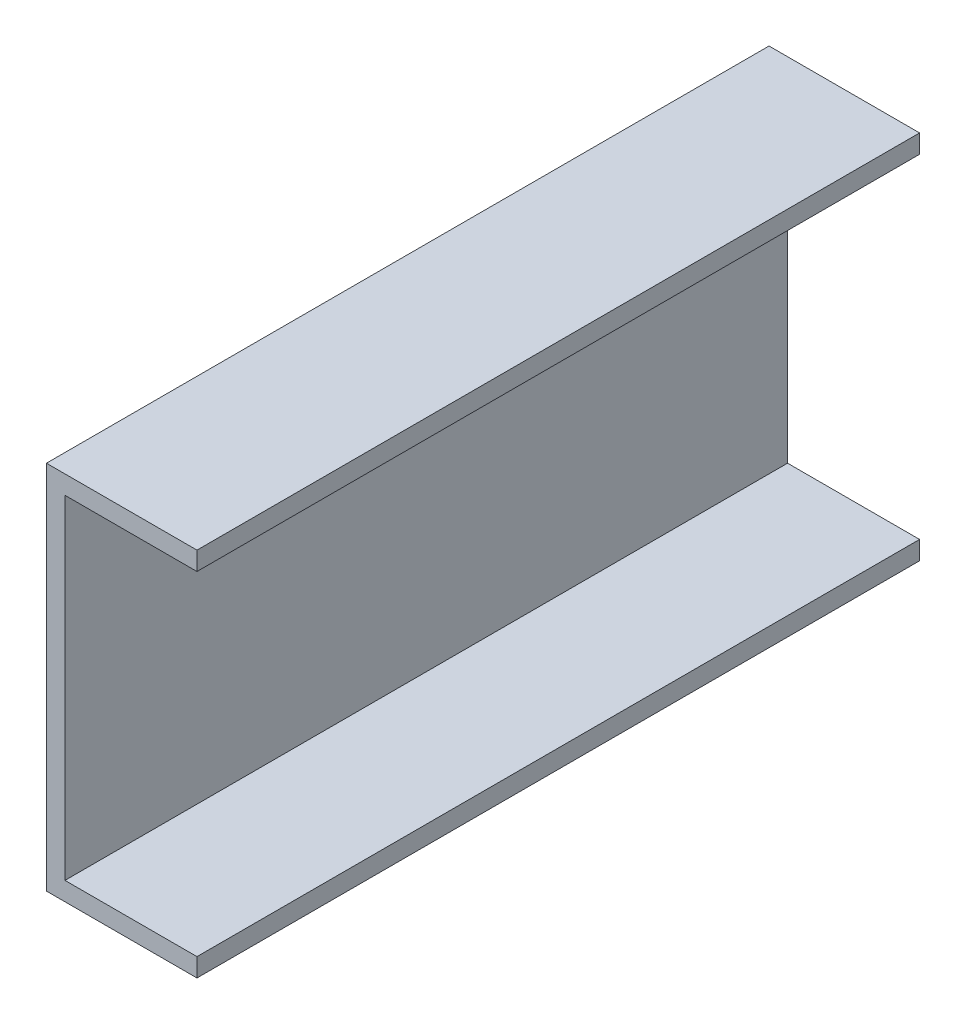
ISO-10303-21;
HEADER;
FILE_DESCRIPTION(('STEP AP214'),'2;1');
FILE_NAME('part.step','',(''),(''),'','','');
FILE_SCHEMA(('AUTOMOTIVE_DESIGN { 1 0 10303 214 1 1 1 1 }'));
ENDSEC;
DATA;
#1=APPLICATION_CONTEXT('core data for automotive mechanical design processes');
#2=APPLICATION_PROTOCOL_DEFINITION('international standard','automotive_design',2000,#1);
#3=PRODUCT_CONTEXT('',#1,'mechanical');
#4=PRODUCT('Part','Part','',(#3));
#5=PRODUCT_RELATED_PRODUCT_CATEGORY('part','',(#4));
#6=PRODUCT_DEFINITION_FORMATION('','',#4);
#7=PRODUCT_DEFINITION_CONTEXT('part definition',#1,'design');
#8=PRODUCT_DEFINITION('design','',#6,#7);
#9=PRODUCT_DEFINITION_SHAPE('','',#8);
#10=(LENGTH_UNIT() NAMED_UNIT(*) SI_UNIT(.MILLI.,.METRE.));
#11=(NAMED_UNIT(*) PLANE_ANGLE_UNIT() SI_UNIT($,.RADIAN.));
#12=(NAMED_UNIT(*) SI_UNIT($,.STERADIAN.) SOLID_ANGLE_UNIT());
#13=UNCERTAINTY_MEASURE_WITH_UNIT(LENGTH_MEASURE(1.E-05),#10,'distance_accuracy_value','');
#14=(GEOMETRIC_REPRESENTATION_CONTEXT(3) GLOBAL_UNCERTAINTY_ASSIGNED_CONTEXT((#13)) GLOBAL_UNIT_ASSIGNED_CONTEXT((#10,
#11,#12)) REPRESENTATION_CONTEXT('',''));
#15=CARTESIAN_POINT('',(0.,0.,0.));
#16=DIRECTION('',(0.,0.,1.));
#17=DIRECTION('',(1.,0.,0.));
#18=AXIS2_PLACEMENT_3D('',#15,#16,#17);
#19=CARTESIAN_POINT('',(65.,8.,312.));
#20=DIRECTION('',(-1.,0.,0.));
#21=DIRECTION('',(0.,0.,1.));
#22=AXIS2_PLACEMENT_3D('',#19,#20,#21);
#23=PLANE('',#22);
#24=DIRECTION('',(0.,1.,0.));
#25=VECTOR('',#24,1.);
#26=CARTESIAN_POINT('',(65.,8.,0.));
#27=LINE('',#26,#25);
#28=CARTESIAN_POINT('',(65.,0.,0.));
#29=VERTEX_POINT('',#28);
#30=CARTESIAN_POINT('',(65.,8.,0.));
#31=VERTEX_POINT('',#30);
#32=EDGE_CURVE('E128',#29,#31,#27,.T.);
#33=ORIENTED_EDGE('',*,*,#32,.T.);
#34=DIRECTION('',(0.,0.,-1.));
#35=VECTOR('',#34,1.);
#36=CARTESIAN_POINT('',(65.,8.,312.));
#37=LINE('',#36,#35);
#38=CARTESIAN_POINT('',(65.,8.,312.));
#39=VERTEX_POINT('',#38);
#40=EDGE_CURVE('E11',#39,#31,#37,.T.);
#41=ORIENTED_EDGE('',*,*,#40,.F.);
#42=DIRECTION('',(0.,1.,0.));
#43=VECTOR('',#42,1.);
#44=CARTESIAN_POINT('',(65.,8.,312.));
#45=LINE('',#44,#43);
#46=CARTESIAN_POINT('',(65.,0.,312.));
#47=VERTEX_POINT('',#46);
#48=EDGE_CURVE('E142',#47,#39,#45,.T.);
#49=ORIENTED_EDGE('',*,*,#48,.F.);
#50=DIRECTION('',(0.,0.,-1.));
#51=VECTOR('',#50,1.);
#52=CARTESIAN_POINT('',(65.,0.,312.));
#53=LINE('',#52,#51);
#54=EDGE_CURVE('E124',#47,#29,#53,.T.);
#55=ORIENTED_EDGE('',*,*,#54,.T.);
#56=EDGE_LOOP('',(#33,#41,#49,#55));
#57=FACE_BOUND('',#56,.T.);
#58=ADVANCED_FACE('F32',(#57),#23,.F.);
#59=CARTESIAN_POINT('',(8.00000000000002,8.,312.));
#60=DIRECTION('',(0.,-1.,0.));
#61=DIRECTION('',(0.,0.,-1.));
#62=AXIS2_PLACEMENT_3D('',#59,#60,#61);
#63=PLANE('',#62);
#64=DIRECTION('',(-1.,0.,0.));
#65=VECTOR('',#64,1.);
#66=CARTESIAN_POINT('',(8.00000000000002,8.,0.));
#67=LINE('',#66,#65);
#68=CARTESIAN_POINT('',(8.00000000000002,8.,0.));
#69=VERTEX_POINT('',#68);
#70=EDGE_CURVE('E131',#31,#69,#67,.T.);
#71=ORIENTED_EDGE('',*,*,#70,.T.);
#72=DIRECTION('',(0.,0.,-1.));
#73=VECTOR('',#72,1.);
#74=CARTESIAN_POINT('',(8.00000000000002,8.,312.));
#75=LINE('',#74,#73);
#76=CARTESIAN_POINT('',(8.00000000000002,8.,312.));
#77=VERTEX_POINT('',#76);
#78=EDGE_CURVE('E40',#77,#69,#75,.T.);
#79=ORIENTED_EDGE('',*,*,#78,.F.);
#80=DIRECTION('',(-1.,0.,0.));
#81=VECTOR('',#80,1.);
#82=CARTESIAN_POINT('',(8.00000000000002,8.,312.));
#83=LINE('',#82,#81);
#84=EDGE_CURVE('E91',#39,#77,#83,.T.);
#85=ORIENTED_EDGE('',*,*,#84,.F.);
#86=ORIENTED_EDGE('',*,*,#40,.T.);
#87=EDGE_LOOP('',(#71,#79,#85,#86));
#88=FACE_BOUND('',#87,.T.);
#89=ADVANCED_FACE('F177',(#88),#63,.F.);
#90=CARTESIAN_POINT('',(8.,152.,312.));
#91=DIRECTION('',(-1.,0.,0.));
#92=DIRECTION('',(0.,-1.,0.));
#93=AXIS2_PLACEMENT_3D('',#90,#91,#92);
#94=PLANE('',#93);
#95=DIRECTION('',(0.,1.,0.));
#96=VECTOR('',#95,1.);
#97=CARTESIAN_POINT('',(8.,152.,0.));
#98=LINE('',#97,#96);
#99=CARTESIAN_POINT('',(8.,152.,0.));
#100=VERTEX_POINT('',#99);
#101=EDGE_CURVE('E133',#69,#100,#98,.T.);
#102=ORIENTED_EDGE('',*,*,#101,.T.);
#103=DIRECTION('',(0.,0.,-1.));
#104=VECTOR('',#103,1.);
#105=CARTESIAN_POINT('',(8.,152.,312.));
#106=LINE('',#105,#104);
#107=CARTESIAN_POINT('',(8.,152.,312.));
#108=VERTEX_POINT('',#107);
#109=EDGE_CURVE('E149',#108,#100,#106,.T.);
#110=ORIENTED_EDGE('',*,*,#109,.F.);
#111=DIRECTION('',(0.,1.,0.));
#112=VECTOR('',#111,1.);
#113=CARTESIAN_POINT('',(8.,152.,312.));
#114=LINE('',#113,#112);
#115=EDGE_CURVE('E157',#77,#108,#114,.T.);
#116=ORIENTED_EDGE('',*,*,#115,.F.);
#117=ORIENTED_EDGE('',*,*,#78,.T.);
#118=EDGE_LOOP('',(#102,#110,#116,#117));
#119=FACE_BOUND('',#118,.T.);
#120=ADVANCED_FACE('F155',(#119),#94,.F.);
#121=CARTESIAN_POINT('',(65.,152.,312.));
#122=DIRECTION('',(0.,1.,0.));
#123=DIRECTION('',(0.,0.,1.));
#124=AXIS2_PLACEMENT_3D('',#121,#122,#123);
#125=PLANE('',#124);
#126=DIRECTION('',(1.,0.,0.));
#127=VECTOR('',#126,1.);
#128=CARTESIAN_POINT('',(65.,152.,0.));
#129=LINE('',#128,#127);
#130=CARTESIAN_POINT('',(65.,152.,0.));
#131=VERTEX_POINT('',#130);
#132=EDGE_CURVE('E135',#100,#131,#129,.T.);
#133=ORIENTED_EDGE('',*,*,#132,.T.);
#134=DIRECTION('',(0.,0.,-1.));
#135=VECTOR('',#134,1.);
#136=CARTESIAN_POINT('',(65.,152.,312.));
#137=LINE('',#136,#135);
#138=CARTESIAN_POINT('',(65.,152.,312.));
#139=VERTEX_POINT('',#138);
#140=EDGE_CURVE('E146',#139,#131,#137,.T.);
#141=ORIENTED_EDGE('',*,*,#140,.F.);
#142=DIRECTION('',(1.,0.,0.));
#143=VECTOR('',#142,1.);
#144=CARTESIAN_POINT('',(65.,152.,312.));
#145=LINE('',#144,#143);
#146=EDGE_CURVE('E169',#108,#139,#145,.T.);
#147=ORIENTED_EDGE('',*,*,#146,.F.);
#148=ORIENTED_EDGE('',*,*,#109,.T.);
#149=EDGE_LOOP('',(#133,#141,#147,#148));
#150=FACE_BOUND('',#149,.T.);
#151=ADVANCED_FACE('F165',(#150),#125,.F.);
#152=CARTESIAN_POINT('',(65.,160.,312.));
#153=DIRECTION('',(-1.,0.,0.));
#154=DIRECTION('',(0.,-1.,0.));
#155=AXIS2_PLACEMENT_3D('',#152,#153,#154);
#156=PLANE('',#155);
#157=DIRECTION('',(0.,1.,0.));
#158=VECTOR('',#157,1.);
#159=CARTESIAN_POINT('',(65.,160.,0.));
#160=LINE('',#159,#158);
#161=CARTESIAN_POINT('',(65.,160.,0.));
#162=VERTEX_POINT('',#161);
#163=EDGE_CURVE('E137',#131,#162,#160,.T.);
#164=ORIENTED_EDGE('',*,*,#163,.T.);
#165=DIRECTION('',(0.,0.,-1.));
#166=VECTOR('',#165,1.);
#167=CARTESIAN_POINT('',(65.,160.,312.));
#168=LINE('',#167,#166);
#169=CARTESIAN_POINT('',(65.,160.,312.));
#170=VERTEX_POINT('',#169);
#171=EDGE_CURVE('E119',#170,#162,#168,.T.);
#172=ORIENTED_EDGE('',*,*,#171,.F.);
#173=DIRECTION('',(0.,1.,0.));
#174=VECTOR('',#173,1.);
#175=CARTESIAN_POINT('',(65.,160.,312.));
#176=LINE('',#175,#174);
#177=EDGE_CURVE('E110',#139,#170,#176,.T.);
#178=ORIENTED_EDGE('',*,*,#177,.F.);
#179=ORIENTED_EDGE('',*,*,#140,.T.);
#180=EDGE_LOOP('',(#164,#172,#178,#179));
#181=FACE_BOUND('',#180,.T.);
#182=ADVANCED_FACE('F168',(#181),#156,.F.);
#183=CARTESIAN_POINT('',(0.,160.,312.));
#184=DIRECTION('',(0.,-1.,0.));
#185=DIRECTION('',(0.,0.,-1.));
#186=AXIS2_PLACEMENT_3D('',#183,#184,#185);
#187=PLANE('',#186);
#188=DIRECTION('',(-1.,0.,0.));
#189=VECTOR('',#188,1.);
#190=CARTESIAN_POINT('',(0.,160.,0.));
#191=LINE('',#190,#189);
#192=CARTESIAN_POINT('',(0.,160.,0.));
#193=VERTEX_POINT('',#192);
#194=EDGE_CURVE('E118',#162,#193,#191,.T.);
#195=ORIENTED_EDGE('',*,*,#194,.T.);
#196=DIRECTION('',(0.,0.,-1.));
#197=VECTOR('',#196,1.);
#198=CARTESIAN_POINT('',(0.,160.,312.));
#199=LINE('',#198,#197);
#200=CARTESIAN_POINT('',(0.,160.,312.));
#201=VERTEX_POINT('',#200);
#202=EDGE_CURVE('E115',#201,#193,#199,.T.);
#203=ORIENTED_EDGE('',*,*,#202,.F.);
#204=DIRECTION('',(-1.,0.,0.));
#205=VECTOR('',#204,1.);
#206=CARTESIAN_POINT('',(0.,160.,312.));
#207=LINE('',#206,#205);
#208=EDGE_CURVE('E104',#170,#201,#207,.T.);
#209=ORIENTED_EDGE('',*,*,#208,.F.);
#210=ORIENTED_EDGE('',*,*,#171,.T.);
#211=EDGE_LOOP('',(#195,#203,#209,#210));
#212=FACE_BOUND('',#211,.T.);
#213=ADVANCED_FACE('F116',(#212),#187,.F.);
#214=CARTESIAN_POINT('',(0.,0.,312.));
#215=DIRECTION('',(1.,0.,0.));
#216=DIRECTION('',(0.,0.,-1.));
#217=AXIS2_PLACEMENT_3D('',#214,#215,#216);
#218=PLANE('',#217);
#219=DIRECTION('',(0.,-1.,0.));
#220=VECTOR('',#219,1.);
#221=CARTESIAN_POINT('',(0.,0.,0.));
#222=LINE('',#221,#220);
#223=CARTESIAN_POINT('',(0.,0.,0.));
#224=VERTEX_POINT('',#223);
#225=EDGE_CURVE('E77',#193,#224,#222,.T.);
#226=ORIENTED_EDGE('',*,*,#225,.T.);
#227=DIRECTION('',(0.,0.,-1.));
#228=VECTOR('',#227,1.);
#229=CARTESIAN_POINT('',(0.,0.,312.));
#230=LINE('',#229,#228);
#231=CARTESIAN_POINT('',(0.,0.,312.));
#232=VERTEX_POINT('',#231);
#233=EDGE_CURVE('E120',#232,#224,#230,.T.);
#234=ORIENTED_EDGE('',*,*,#233,.F.);
#235=DIRECTION('',(0.,-1.,0.));
#236=VECTOR('',#235,1.);
#237=CARTESIAN_POINT('',(0.,0.,312.));
#238=LINE('',#237,#236);
#239=EDGE_CURVE('E108',#201,#232,#238,.T.);
#240=ORIENTED_EDGE('',*,*,#239,.F.);
#241=ORIENTED_EDGE('',*,*,#202,.T.);
#242=EDGE_LOOP('',(#226,#234,#240,#241));
#243=FACE_BOUND('',#242,.T.);
#244=ADVANCED_FACE('F122',(#243),#218,.F.);
#245=CARTESIAN_POINT('',(65.,0.,312.));
#246=DIRECTION('',(0.,1.,0.));
#247=DIRECTION('',(-1.,0.,0.));
#248=AXIS2_PLACEMENT_3D('',#245,#246,#247);
#249=PLANE('',#248);
#250=DIRECTION('',(1.,0.,0.));
#251=VECTOR('',#250,1.);
#252=CARTESIAN_POINT('',(65.,0.,0.));
#253=LINE('',#252,#251);
#254=EDGE_CURVE('E83',#224,#29,#253,.T.);
#255=ORIENTED_EDGE('',*,*,#254,.T.);
#256=ORIENTED_EDGE('',*,*,#54,.F.);
#257=DIRECTION('',(1.,0.,0.));
#258=VECTOR('',#257,1.);
#259=CARTESIAN_POINT('',(65.,0.,312.));
#260=LINE('',#259,#258);
#261=EDGE_CURVE('E48',#232,#47,#260,.T.);
#262=ORIENTED_EDGE('',*,*,#261,.F.);
#263=ORIENTED_EDGE('',*,*,#233,.T.);
#264=EDGE_LOOP('',(#255,#256,#262,#263));
#265=FACE_BOUND('',#264,.T.);
#266=ADVANCED_FACE('F193',(#265),#249,.F.);
#267=CARTESIAN_POINT('',(0.,0.,312.));
#268=DIRECTION('',(0.,0.,-1.));
#269=DIRECTION('',(-1.,0.,0.));
#270=AXIS2_PLACEMENT_3D('',#267,#268,#269);
#271=PLANE('',#270);
#272=ORIENTED_EDGE('',*,*,#48,.T.);
#273=ORIENTED_EDGE('',*,*,#84,.T.);
#274=ORIENTED_EDGE('',*,*,#115,.T.);
#275=ORIENTED_EDGE('',*,*,#146,.T.);
#276=ORIENTED_EDGE('',*,*,#177,.T.);
#277=ORIENTED_EDGE('',*,*,#208,.T.);
#278=ORIENTED_EDGE('',*,*,#239,.T.);
#279=ORIENTED_EDGE('',*,*,#261,.T.);
#280=EDGE_LOOP('',(#272,#273,#274,#275,#276,#277,#278,#279));
#281=FACE_BOUND('',#280,.T.);
#282=ADVANCED_FACE('F106',(#281),#271,.F.);
#283=CARTESIAN_POINT('',(0.,0.,0.));
#284=DIRECTION('',(0.,0.,-1.));
#285=DIRECTION('',(-1.,0.,0.));
#286=AXIS2_PLACEMENT_3D('',#283,#284,#285);
#287=PLANE('',#286);
#288=ORIENTED_EDGE('',*,*,#32,.F.);
#289=ORIENTED_EDGE('',*,*,#254,.F.);
#290=ORIENTED_EDGE('',*,*,#225,.F.);
#291=ORIENTED_EDGE('',*,*,#194,.F.);
#292=ORIENTED_EDGE('',*,*,#163,.F.);
#293=ORIENTED_EDGE('',*,*,#132,.F.);
#294=ORIENTED_EDGE('',*,*,#101,.F.);
#295=ORIENTED_EDGE('',*,*,#70,.F.);
#296=EDGE_LOOP('',(#288,#289,#290,#291,#292,#293,#294,#295));
#297=FACE_BOUND('',#296,.T.);
#298=ADVANCED_FACE('F161',(#297),#287,.T.);
#299=CLOSED_SHELL('',(#58,#89,#120,#151,#182,#213,#244,#266,#282,#298));
#300=MANIFOLD_SOLID_BREP('B2',#299);
#301=ADVANCED_BREP_SHAPE_REPRESENTATION('',(#18,#300),#14);
#302=SHAPE_DEFINITION_REPRESENTATION(#9,#301);
ENDSEC;
END-ISO-10303-21;
